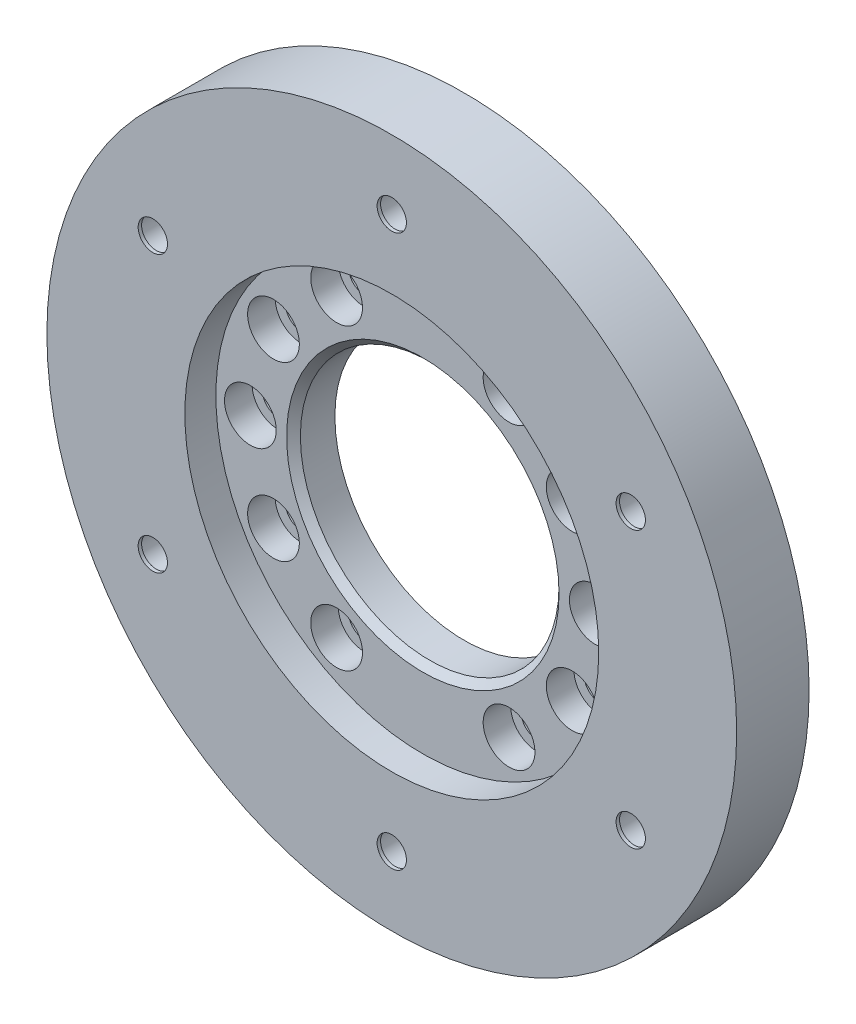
from build123d import *

# Parameters (mm, degrees)
ESQUISSE1_R                                        = 100
EXTRUSION1_DEPTH                                   = 21
R_P_TITION_CIRCULAIRE5_COUNT                       = 6
ESQUISSE13_R                                       = 60
EXTRUSION3_DEPTH                                   = 9
CHAMBRAGE_POUR_VIS_T_TE_HEXAGONALE_M81_D           = 9
CHAMBRAGE_POUR_VIS_T_TE_HEXAGONALE_M81_CBORE_D     = 15
CHAMBRAGE_POUR_VIS_T_TE_HEXAGONALE_M81_CBORE_DEPTH = 8
R_P_TITION_CIRCULAIRE6_COUNT                       = 3
R_P_TITION_CIRCULAIRE6_ANGLE                       = 60
R_P_TITION_CIRCULAIRE7_COUNT                       = 3
R_P_TITION_CIRCULAIRE7_ANGLE                       = 60
CHAMBRAGE_POUR_VIS_T_TE_HEXAGONALE_M82_D           = 9
CHAMBRAGE_POUR_VIS_T_TE_HEXAGONALE_M82_CBORE_D     = 15
CHAMBRAGE_POUR_VIS_T_TE_HEXAGONALE_M82_CBORE_DEPTH = 8
R_P_TITION_CIRCULAIRE8_COUNT                       = 3
R_P_TITION_CIRCULAIRE8_ANGLE                       = 60
R_P_TITION_CIRCULAIRE9_COUNT                       = 3
R_P_TITION_CIRCULAIRE9_ANGLE                       = 60
EXTRUSION4_REACH                                   = 143.93
ESQUISSE19_R                                       = 37.5
CHANFREIN1_SIZE                                    = 2


with BuildPart() as part:
    # Esquisse1 → Extrusion1 (new body)
    with BuildSketch(Plane.XY):
        with Locations(Location((0, 0, 0), (0, 0, 180))):
            Circle(ESQUISSE1_R)
    extrude(amount=EXTRUSION1_DEPTH)

    # Esquisse9 → Trou taraud_ M101 (revolve, cut)
    with BuildSketch(Plane(origin=(0, 80, 0), x_dir=(0, 1, 0), z_dir=(1, 0, 0))):
        Polygon((0, 0), (0, 27.053657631), (4.25, 24.5), (4.25, 20), (5, 20), (5, 0), align=None)
    trou_taraud_m101 = revolve(axis=Axis((0, 80, -6.35), (0, 0, 1)), mode=Mode.SUBTRACT)

    # R_p_tition circulaire5: Trou taraud_ M101 ×6 about axis
    r_p_tition_circulaire5_axis = Axis((0, 0, 0), (0, 0, 1))
    for i in range(1, R_P_TITION_CIRCULAIRE5_COUNT):
        add(trou_taraud_m101.rotate(r_p_tition_circulaire5_axis, i * 360 / R_P_TITION_CIRCULAIRE5_COUNT), mode=Mode.SUBTRACT)

    # Esquisse13 → Extrusion3 (cut)
    with BuildSketch(Plane.XY.offset(21)):
        Circle(ESQUISSE13_R)
    extrude(amount=-EXTRUSION3_DEPTH, mode=Mode.SUBTRACT)

    # Chambrage pour vis _ t_te hexagonale M81 (through all)
    with Locations(Plane(origin=(-50, 0, 12), x_dir=(1, 0, 0), z_dir=(0, 0, 1))):
        with Locations((0, 0)):
            chambrage_pour_vis_t_te_hexagonale_m81 = CounterBoreHole(CHAMBRAGE_POUR_VIS_T_TE_HEXAGONALE_M81_D / 2, CHAMBRAGE_POUR_VIS_T_TE_HEXAGONALE_M81_CBORE_D / 2, CHAMBRAGE_POUR_VIS_T_TE_HEXAGONALE_M81_CBORE_DEPTH)

    # R_p_tition circulaire6: Chambrage pour vis _ t_te hexagonale M81 ×3 about axis
    r_p_tition_circulaire6_axis = Axis((0, 0, 0), (0, 0, -1))
    for i in range(1, R_P_TITION_CIRCULAIRE6_COUNT):
        add(chambrage_pour_vis_t_te_hexagonale_m81.rotate(r_p_tition_circulaire6_axis, i * R_P_TITION_CIRCULAIRE6_ANGLE / (R_P_TITION_CIRCULAIRE6_COUNT - 1)), mode=Mode.SUBTRACT)

    # R_p_tition circulaire7: Chambrage pour vis _ t_te hexagonale M81 ×3 about axis
    r_p_tition_circulaire7_axis = Axis((0, 0, 0), (0, 0, 1))
    for i in range(1, R_P_TITION_CIRCULAIRE7_COUNT):
        add(chambrage_pour_vis_t_te_hexagonale_m81.rotate(r_p_tition_circulaire7_axis, i * R_P_TITION_CIRCULAIRE7_ANGLE / (R_P_TITION_CIRCULAIRE7_COUNT - 1)), mode=Mode.SUBTRACT)

    # Chambrage pour vis _ t_te hexagonale M82 (through all)
    with Locations(Plane(origin=(50, 0, 12), x_dir=(1, 0, 0), z_dir=(0, 0, 1))):
        with Locations((0, 0)):
            chambrage_pour_vis_t_te_hexagonale_m82 = CounterBoreHole(CHAMBRAGE_POUR_VIS_T_TE_HEXAGONALE_M82_D / 2, CHAMBRAGE_POUR_VIS_T_TE_HEXAGONALE_M82_CBORE_D / 2, CHAMBRAGE_POUR_VIS_T_TE_HEXAGONALE_M82_CBORE_DEPTH)

    # R_p_tition circulaire8: Chambrage pour vis _ t_te hexagonale M82 ×3 about axis
    r_p_tition_circulaire8_axis = Axis((0, 0, 0), (0, 0, -1))
    for i in range(1, R_P_TITION_CIRCULAIRE8_COUNT):
        add(chambrage_pour_vis_t_te_hexagonale_m82.rotate(r_p_tition_circulaire8_axis, i * R_P_TITION_CIRCULAIRE8_ANGLE / (R_P_TITION_CIRCULAIRE8_COUNT - 1)), mode=Mode.SUBTRACT)

    # R_p_tition circulaire9: Chambrage pour vis _ t_te hexagonale M82 ×3 about axis
    r_p_tition_circulaire9_axis = Axis((0, 0, 0), (0, 0, 1))
    for i in range(1, R_P_TITION_CIRCULAIRE9_COUNT):
        add(chambrage_pour_vis_t_te_hexagonale_m82.rotate(r_p_tition_circulaire9_axis, i * R_P_TITION_CIRCULAIRE9_ANGLE / (R_P_TITION_CIRCULAIRE9_COUNT - 1)), mode=Mode.SUBTRACT)

    # Esquisse19 → Extrusion4 (cut, up to next)
    with BuildSketch(Plane.XY.offset(12), mode=Mode.PRIVATE) as extrusion4_sk1:
        Circle(ESQUISSE19_R)
    extrusion4_tool1 = extrude(extrusion4_sk1.sketch, amount=-EXTRUSION4_REACH, mode=Mode.PRIVATE) & part.part
    add(extrusion4_tool1.solids().sort_by_distance((0, 0, 12))[0], mode=Mode.SUBTRACT)

    # Chanfrein1
    chanfrein1_edges = [part.edges().sort_by_distance(p)[0] for p in [
        (-37.5, 0, 12),
    ]]
    chamfer(chanfrein1_edges, length=CHANFREIN1_SIZE)


solid = part.part
